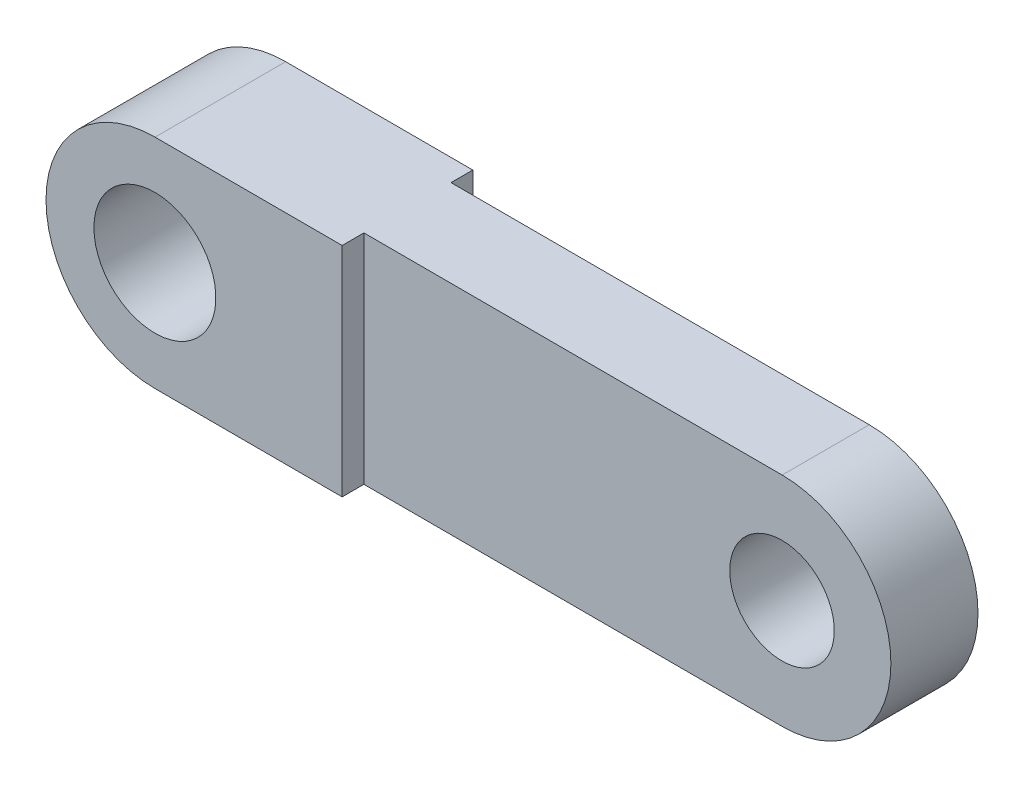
ISO-10303-21;
HEADER;
FILE_DESCRIPTION(('STEP AP214'),'2;1');
FILE_NAME('part.step','',(''),(''),'','','');
FILE_SCHEMA(('AUTOMOTIVE_DESIGN { 1 0 10303 214 1 1 1 1 }'));
ENDSEC;
DATA;
#1=APPLICATION_CONTEXT('core data for automotive mechanical design processes');
#2=APPLICATION_PROTOCOL_DEFINITION('international standard','automotive_design',2000,#1);
#3=PRODUCT_CONTEXT('',#1,'mechanical');
#4=PRODUCT('Part','Part','',(#3));
#5=PRODUCT_RELATED_PRODUCT_CATEGORY('part','',(#4));
#6=PRODUCT_DEFINITION_FORMATION('','',#4);
#7=PRODUCT_DEFINITION_CONTEXT('part definition',#1,'design');
#8=PRODUCT_DEFINITION('design','',#6,#7);
#9=PRODUCT_DEFINITION_SHAPE('','',#8);
#10=(LENGTH_UNIT() NAMED_UNIT(*) SI_UNIT(.MILLI.,.METRE.));
#11=(NAMED_UNIT(*) PLANE_ANGLE_UNIT() SI_UNIT($,.RADIAN.));
#12=(NAMED_UNIT(*) SI_UNIT($,.STERADIAN.) SOLID_ANGLE_UNIT());
#13=UNCERTAINTY_MEASURE_WITH_UNIT(LENGTH_MEASURE(1.E-05),#10,'distance_accuracy_value','');
#14=(GEOMETRIC_REPRESENTATION_CONTEXT(3) GLOBAL_UNCERTAINTY_ASSIGNED_CONTEXT((#13)) GLOBAL_UNIT_ASSIGNED_CONTEXT((#10,
#11,#12)) REPRESENTATION_CONTEXT('',''));
#15=CARTESIAN_POINT('',(0.,0.,0.));
#16=DIRECTION('',(0.,0.,1.));
#17=DIRECTION('',(1.,0.,0.));
#18=AXIS2_PLACEMENT_3D('',#15,#16,#17);
#19=CARTESIAN_POINT('',(-5.5,-0.094581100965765,-2.5));
#20=DIRECTION('',(0.,0.,-1.));
#21=DIRECTION('',(0.,1.,0.));
#22=AXIS2_PLACEMENT_3D('',#19,#20,#21);
#23=CYLINDRICAL_SURFACE('',#22,6.);
#24=CARTESIAN_POINT('',(-5.5,-0.0945811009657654,-12.5));
#25=DIRECTION('',(0.,0.,-1.));
#26=DIRECTION('',(0.,1.,0.));
#27=AXIS2_PLACEMENT_3D('',#24,#25,#26);
#28=CIRCLE('',#27,6.);
#29=CARTESIAN_POINT('',(-5.5,5.90541889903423,-12.5));
#30=VERTEX_POINT('',#29);
#31=EDGE_CURVE('E16',#30,#30,#28,.T.);
#32=ORIENTED_EDGE('',*,*,#31,.T.);
#33=EDGE_LOOP('',(#32));
#34=FACE_BOUND('',#33,.T.);
#35=CARTESIAN_POINT('',(-5.5,-0.094581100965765,-2.5));
#36=DIRECTION('',(0.,0.,-1.));
#37=DIRECTION('',(0.,1.,0.));
#38=AXIS2_PLACEMENT_3D('',#35,#36,#37);
#39=CIRCLE('',#38,6.);
#40=CARTESIAN_POINT('',(-5.5,5.90541889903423,-2.5));
#41=VERTEX_POINT('',#40);
#42=EDGE_CURVE('E94',#41,#41,#39,.F.);
#43=ORIENTED_EDGE('',*,*,#42,.T.);
#44=EDGE_LOOP('',(#43));
#45=FACE_BOUND('',#44,.T.);
#46=ADVANCED_FACE('F12',(#34,#45),#23,.F.);
#47=CARTESIAN_POINT('',(-53.5,-12.529270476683,-15.));
#48=DIRECTION('',(-1.,0.,0.));
#49=DIRECTION('',(0.,0.,1.));
#50=AXIS2_PLACEMENT_3D('',#47,#48,#49);
#51=PLANE('',#50);
#52=DIRECTION('',(0.,-1.,0.));
#53=VECTOR('',#52,1.);
#54=CARTESIAN_POINT('',(-53.5,-17.779247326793,-12.5));
#55=LINE('',#54,#53);
#56=CARTESIAN_POINT('',(-53.5000000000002,12.4707526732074,-12.5000000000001));
#57=VERTEX_POINT('',#56);
#58=CARTESIAN_POINT('',(-53.4999999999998,-12.5292704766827,-12.5000000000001));
#59=VERTEX_POINT('',#58);
#60=EDGE_CURVE('E72',#57,#59,#55,.T.);
#61=ORIENTED_EDGE('',*,*,#60,.T.);
#62=DIRECTION('',(0.,0.,1.));
#63=VECTOR('',#62,1.);
#64=CARTESIAN_POINT('',(-53.4999999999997,-12.5292704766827,-34.750032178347));
#65=LINE('',#64,#63);
#66=CARTESIAN_POINT('',(-53.4999999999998,-12.5292704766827,-15.0000000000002));
#67=VERTEX_POINT('',#66);
#68=EDGE_CURVE('E97',#67,#59,#65,.T.);
#69=ORIENTED_EDGE('',*,*,#68,.F.);
#70=DIRECTION('',(0.,-1.,0.));
#71=VECTOR('',#70,1.);
#72=CARTESIAN_POINT('',(-53.5,-4.33,-15.));
#73=LINE('',#72,#71);
#74=CARTESIAN_POINT('',(-53.5000000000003,12.4707526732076,-15.0000000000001));
#75=VERTEX_POINT('',#74);
#76=EDGE_CURVE('E79',#75,#67,#73,.T.);
#77=ORIENTED_EDGE('',*,*,#76,.F.);
#78=DIRECTION('',(0.,0.,-1.));
#79=VECTOR('',#78,1.);
#80=CARTESIAN_POINT('',(-53.5000000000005,12.4707526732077,-34.750032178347));
#81=LINE('',#80,#79);
#82=EDGE_CURVE('E116',#57,#75,#81,.T.);
#83=ORIENTED_EDGE('',*,*,#82,.F.);
#84=EDGE_LOOP('',(#61,#69,#77,#83));
#85=FACE_BOUND('',#84,.T.);
#86=ADVANCED_FACE('F98',(#85),#51,.F.);
#87=CARTESIAN_POINT('',(7.605,12.470752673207,-12.5));
#88=DIRECTION('',(0.,0.,1.));
#89=DIRECTION('',(-1.,0.,0.));
#90=AXIS2_PLACEMENT_3D('',#87,#88,#89);
#91=PLANE('',#90);
#92=ORIENTED_EDGE('',*,*,#31,.F.);
#93=EDGE_LOOP('',(#92));
#94=FACE_BOUND('',#93,.T.);
#95=CARTESIAN_POINT('',(-5.5,-0.094581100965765,-12.5));
#96=DIRECTION('',(0.,0.,1.));
#97=DIRECTION('',(1.,0.,0.));
#98=AXIS2_PLACEMENT_3D('',#95,#96,#97);
#99=CIRCLE('',#98,12.5000000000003);
#100=CARTESIAN_POINT('',(-5.48298902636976,12.4054073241,-12.5000000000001));
#101=VERTEX_POINT('',#100);
#102=CARTESIAN_POINT('',(-5.51701097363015,-12.594569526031,-12.5000000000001));
#103=VERTEX_POINT('',#102);
#104=EDGE_CURVE('E66',#101,#103,#99,.F.);
#105=ORIENTED_EDGE('',*,*,#104,.T.);
#106=DIRECTION('',(0.999999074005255,-0.0013608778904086,0.));
#107=VECTOR('',#106,1.);
#108=CARTESIAN_POINT('',(-40.2670109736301,-12.5472789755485,-12.5000000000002));
#109=LINE('',#108,#107);
#110=EDGE_CURVE('E100',#59,#103,#109,.T.);
#111=ORIENTED_EDGE('',*,*,#110,.F.);
#112=ORIENTED_EDGE('',*,*,#60,.F.);
#113=DIRECTION('',(-0.999999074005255,0.00136087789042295,0.));
#114=VECTOR('',#113,1.);
#115=CARTESIAN_POINT('',(-40.2329890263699,12.452697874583,-12.5000000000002));
#116=LINE('',#115,#114);
#117=EDGE_CURVE('E120',#101,#57,#116,.T.);
#118=ORIENTED_EDGE('',*,*,#117,.F.);
#119=EDGE_LOOP('',(#105,#111,#112,#118));
#120=FACE_BOUND('',#119,.T.);
#121=ADVANCED_FACE('F195',(#94,#120),#91,.F.);
#122=CARTESIAN_POINT('',(-5.5,-0.094581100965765,-12.5));
#123=DIRECTION('',(0.,0.,1.));
#124=DIRECTION('',(1.,0.,0.));
#125=AXIS2_PLACEMENT_3D('',#122,#123,#124);
#126=CYLINDRICAL_SURFACE('',#125,12.5000000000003);
#127=ORIENTED_EDGE('',*,*,#104,.F.);
#128=DIRECTION('',(0.,0.,-1.));
#129=VECTOR('',#128,1.);
#130=CARTESIAN_POINT('',(-5.4829890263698,12.4054073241,-34.750032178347));
#131=LINE('',#130,#129);
#132=CARTESIAN_POINT('',(-5.48298902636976,12.4054073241,-2.49999999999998));
#133=VERTEX_POINT('',#132);
#134=EDGE_CURVE('E125',#133,#101,#131,.T.);
#135=ORIENTED_EDGE('',*,*,#134,.F.);
#136=CARTESIAN_POINT('',(-5.5,-0.094581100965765,-2.5));
#137=DIRECTION('',(0.,0.,1.));
#138=DIRECTION('',(1.,0.,0.));
#139=AXIS2_PLACEMENT_3D('',#136,#137,#138);
#140=CIRCLE('',#139,12.5000000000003);
#141=CARTESIAN_POINT('',(-5.51701097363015,-12.594569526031,-2.49999999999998));
#142=VERTEX_POINT('',#141);
#143=EDGE_CURVE('E145',#133,#142,#140,.F.);
#144=ORIENTED_EDGE('',*,*,#143,.T.);
#145=DIRECTION('',(0.,0.,1.));
#146=VECTOR('',#145,1.);
#147=CARTESIAN_POINT('',(-5.5170109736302,-12.594569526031,-34.750032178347));
#148=LINE('',#147,#146);
#149=EDGE_CURVE('E156',#103,#142,#148,.T.);
#150=ORIENTED_EDGE('',*,*,#149,.F.);
#151=EDGE_LOOP('',(#127,#135,#144,#150));
#152=FACE_BOUND('',#151,.T.);
#153=ADVANCED_FACE('F194',(#152),#126,.T.);
#154=CARTESIAN_POINT('',(7.605,-13.199581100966,-2.5));
#155=DIRECTION('',(0.,0.,-1.));
#156=DIRECTION('',(-1.,0.,0.));
#157=AXIS2_PLACEMENT_3D('',#154,#155,#156);
#158=PLANE('',#157);
#159=ORIENTED_EDGE('',*,*,#42,.F.);
#160=EDGE_LOOP('',(#159));
#161=FACE_BOUND('',#160,.T.);
#162=DIRECTION('',(-0.999999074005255,0.0013608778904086,0.));
#163=VECTOR('',#162,1.);
#164=CARTESIAN_POINT('',(-40.2670109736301,-12.5472789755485,-2.49999999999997));
#165=LINE('',#164,#163);
#166=CARTESIAN_POINT('',(-53.5,-12.5292704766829,-2.49999999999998));
#167=VERTEX_POINT('',#166);
#168=EDGE_CURVE('E159',#142,#167,#165,.T.);
#169=ORIENTED_EDGE('',*,*,#168,.F.);
#170=ORIENTED_EDGE('',*,*,#143,.F.);
#171=DIRECTION('',(0.999999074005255,-0.00136087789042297,0.));
#172=VECTOR('',#171,1.);
#173=CARTESIAN_POINT('',(-40.2329890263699,12.452697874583,-2.49999999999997));
#174=LINE('',#173,#172);
#175=CARTESIAN_POINT('',(-53.5000000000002,12.4707526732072,-2.49999999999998));
#176=VERTEX_POINT('',#175);
#177=EDGE_CURVE('E93',#176,#133,#174,.T.);
#178=ORIENTED_EDGE('',*,*,#177,.F.);
#179=DIRECTION('',(0.,-1.,0.));
#180=VECTOR('',#179,1.);
#181=CARTESIAN_POINT('',(-53.5,-0.0292589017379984,-2.49999999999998));
#182=LINE('',#181,#180);
#183=EDGE_CURVE('E166',#176,#167,#182,.T.);
#184=ORIENTED_EDGE('',*,*,#183,.T.);
#185=EDGE_LOOP('',(#169,#170,#178,#184));
#186=FACE_BOUND('',#185,.T.);
#187=ADVANCED_FACE('F193',(#161,#186),#158,.F.);
#188=CARTESIAN_POINT('',(-87.84,12.84,-15.));
#189=DIRECTION('',(0.,0.,-1.));
#190=DIRECTION('',(1.,0.,0.));
#191=AXIS2_PLACEMENT_3D('',#188,#189,#190);
#192=PLANE('',#191);
#193=CARTESIAN_POINT('',(-75.,0.,-15.));
#194=DIRECTION('',(0.,0.,-1.));
#195=DIRECTION('',(-1.,0.,0.));
#196=AXIS2_PLACEMENT_3D('',#193,#194,#195);
#197=CIRCLE('',#196,6.99999999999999);
#198=CARTESIAN_POINT('',(-82.,0.,-15.));
#199=VERTEX_POINT('',#198);
#200=EDGE_CURVE('E139',#199,#199,#197,.T.);
#201=ORIENTED_EDGE('',*,*,#200,.F.);
#202=EDGE_LOOP('',(#201));
#203=FACE_BOUND('',#202,.T.);
#204=CARTESIAN_POINT('',(-75.,0.,-15.));
#205=DIRECTION('',(0.,0.,1.));
#206=DIRECTION('',(0.,-1.,0.));
#207=AXIS2_PLACEMENT_3D('',#204,#205,#206);
#208=CIRCLE('',#207,12.5000000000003);
#209=CARTESIAN_POINT('',(-75.0170109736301,-12.499988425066,-15.0000000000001));
#210=VERTEX_POINT('',#209);
#211=CARTESIAN_POINT('',(-74.9829890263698,12.499988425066,-15.0000000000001));
#212=VERTEX_POINT('',#211);
#213=EDGE_CURVE('E115',#210,#212,#208,.F.);
#214=ORIENTED_EDGE('',*,*,#213,.T.);
#215=DIRECTION('',(-0.999999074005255,0.00136087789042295,0.));
#216=VECTOR('',#215,1.);
#217=CARTESIAN_POINT('',(-40.2329890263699,12.452697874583,-15.0000000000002));
#218=LINE('',#217,#216);
#219=EDGE_CURVE('E91',#75,#212,#218,.T.);
#220=ORIENTED_EDGE('',*,*,#219,.F.);
#221=ORIENTED_EDGE('',*,*,#76,.T.);
#222=DIRECTION('',(0.999999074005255,-0.00136087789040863,0.));
#223=VECTOR('',#222,1.);
#224=CARTESIAN_POINT('',(-40.2670109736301,-12.5472789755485,-15.0000000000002));
#225=LINE('',#224,#223);
#226=EDGE_CURVE('E88',#210,#67,#225,.T.);
#227=ORIENTED_EDGE('',*,*,#226,.F.);
#228=EDGE_LOOP('',(#214,#220,#221,#227));
#229=FACE_BOUND('',#228,.T.);
#230=ADVANCED_FACE('F86',(#203,#229),#192,.T.);
#231=CARTESIAN_POINT('',(-5.4829890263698,12.4054073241,0.));
#232=DIRECTION('',(0.00136087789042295,0.999999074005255,0.));
#233=DIRECTION('',(0.,0.,-1.));
#234=AXIS2_PLACEMENT_3D('',#231,#232,#233);
#235=PLANE('',#234);
#236=ORIENTED_EDGE('',*,*,#219,.T.);
#237=DIRECTION('',(0.,0.,1.));
#238=VECTOR('',#237,1.);
#239=CARTESIAN_POINT('',(-74.9829890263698,12.499988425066,-7.5));
#240=LINE('',#239,#238);
#241=CARTESIAN_POINT('',(-74.9829890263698,12.4999884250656,0.));
#242=VERTEX_POINT('',#241);
#243=EDGE_CURVE('E105',#212,#242,#240,.T.);
#244=ORIENTED_EDGE('',*,*,#243,.T.);
#245=DIRECTION('',(-0.999999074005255,0.00136087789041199,0.));
#246=VECTOR('',#245,1.);
#247=CARTESIAN_POINT('',(-53.5,12.4707526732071,0.));
#248=LINE('',#247,#246);
#249=CARTESIAN_POINT('',(-53.5,12.4707526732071,0.));
#250=VERTEX_POINT('',#249);
#251=EDGE_CURVE('E136',#250,#242,#248,.T.);
#252=ORIENTED_EDGE('',*,*,#251,.F.);
#253=DIRECTION('',(0.,0.,-1.));
#254=VECTOR('',#253,1.);
#255=CARTESIAN_POINT('',(-53.5,12.470752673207,-12.500011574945));
#256=LINE('',#255,#254);
#257=EDGE_CURVE('E169',#250,#176,#256,.T.);
#258=ORIENTED_EDGE('',*,*,#257,.T.);
#259=ORIENTED_EDGE('',*,*,#177,.T.);
#260=ORIENTED_EDGE('',*,*,#134,.T.);
#261=ORIENTED_EDGE('',*,*,#117,.T.);
#262=ORIENTED_EDGE('',*,*,#82,.T.);
#263=EDGE_LOOP('',(#236,#244,#252,#258,#259,#260,#261,#262));
#264=FACE_BOUND('',#263,.T.);
#265=ADVANCED_FACE('F188',(#264),#235,.T.);
#266=CARTESIAN_POINT('',(-75.,0.,-15.));
#267=DIRECTION('',(0.,0.,1.));
#268=DIRECTION('',(0.,-1.,0.));
#269=AXIS2_PLACEMENT_3D('',#266,#267,#268);
#270=CYLINDRICAL_SURFACE('',#269,12.5000000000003);
#271=ORIENTED_EDGE('',*,*,#243,.F.);
#272=ORIENTED_EDGE('',*,*,#213,.F.);
#273=DIRECTION('',(0.,0.,-1.));
#274=VECTOR('',#273,1.);
#275=CARTESIAN_POINT('',(-75.01701097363,-12.499988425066,-34.750032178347));
#276=LINE('',#275,#274);
#277=CARTESIAN_POINT('',(-75.0170109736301,-12.499988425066,0.));
#278=VERTEX_POINT('',#277);
#279=EDGE_CURVE('E103',#278,#210,#276,.T.);
#280=ORIENTED_EDGE('',*,*,#279,.F.);
#281=CARTESIAN_POINT('',(-75.,0.,0.));
#282=DIRECTION('',(0.,0.,1.));
#283=DIRECTION('',(0.,-1.,0.));
#284=AXIS2_PLACEMENT_3D('',#281,#282,#283);
#285=CIRCLE('',#284,12.5000000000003);
#286=EDGE_CURVE('E133',#242,#278,#285,.T.);
#287=ORIENTED_EDGE('',*,*,#286,.F.);
#288=EDGE_LOOP('',(#271,#272,#280,#287));
#289=FACE_BOUND('',#288,.T.);
#290=ADVANCED_FACE('F218',(#289),#270,.T.);
#291=CARTESIAN_POINT('',(-75.01701097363,-12.499988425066,0.));
#292=DIRECTION('',(-0.0013608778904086,-0.999999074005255,0.));
#293=DIRECTION('',(0.,0.,-1.));
#294=AXIS2_PLACEMENT_3D('',#291,#292,#293);
#295=PLANE('',#294);
#296=ORIENTED_EDGE('',*,*,#168,.T.);
#297=DIRECTION('',(0.,0.,1.));
#298=VECTOR('',#297,1.);
#299=CARTESIAN_POINT('',(-53.5,-12.529270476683,-12.500011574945));
#300=LINE('',#299,#298);
#301=CARTESIAN_POINT('',(-53.5,-12.529270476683,0.));
#302=VERTEX_POINT('',#301);
#303=EDGE_CURVE('E31',#167,#302,#300,.T.);
#304=ORIENTED_EDGE('',*,*,#303,.T.);
#305=DIRECTION('',(0.999999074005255,-0.00136087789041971,0.));
#306=VECTOR('',#305,1.);
#307=CARTESIAN_POINT('',(-75.0170109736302,-12.499988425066,0.));
#308=LINE('',#307,#306);
#309=EDGE_CURVE('E130',#278,#302,#308,.T.);
#310=ORIENTED_EDGE('',*,*,#309,.F.);
#311=ORIENTED_EDGE('',*,*,#279,.T.);
#312=ORIENTED_EDGE('',*,*,#226,.T.);
#313=ORIENTED_EDGE('',*,*,#68,.T.);
#314=ORIENTED_EDGE('',*,*,#110,.T.);
#315=ORIENTED_EDGE('',*,*,#149,.T.);
#316=EDGE_LOOP('',(#296,#304,#310,#311,#312,#313,#314,#315));
#317=FACE_BOUND('',#316,.T.);
#318=ADVANCED_FACE('F102',(#317),#295,.T.);
#319=CARTESIAN_POINT('',(-53.5,12.470752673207,0.));
#320=DIRECTION('',(-1.,0.,0.));
#321=DIRECTION('',(0.,0.,-1.));
#322=AXIS2_PLACEMENT_3D('',#319,#320,#321);
#323=PLANE('',#322);
#324=ORIENTED_EDGE('',*,*,#303,.F.);
#325=ORIENTED_EDGE('',*,*,#183,.F.);
#326=ORIENTED_EDGE('',*,*,#257,.F.);
#327=DIRECTION('',(0.,1.,0.));
#328=VECTOR('',#327,1.);
#329=CARTESIAN_POINT('',(-53.5,4.470729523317,0.));
#330=LINE('',#329,#328);
#331=EDGE_CURVE('E22',#302,#250,#330,.T.);
#332=ORIENTED_EDGE('',*,*,#331,.F.);
#333=EDGE_LOOP('',(#324,#325,#326,#332));
#334=FACE_BOUND('',#333,.T.);
#335=ADVANCED_FACE('F185',(#334),#323,.F.);
#336=CARTESIAN_POINT('',(-75.,0.,0.));
#337=DIRECTION('',(0.,0.,-1.));
#338=DIRECTION('',(-1.,0.,0.));
#339=AXIS2_PLACEMENT_3D('',#336,#337,#338);
#340=CYLINDRICAL_SURFACE('',#339,6.99999999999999);
#341=ORIENTED_EDGE('',*,*,#200,.T.);
#342=EDGE_LOOP('',(#341));
#343=FACE_BOUND('',#342,.T.);
#344=CARTESIAN_POINT('',(-75.,0.,0.));
#345=DIRECTION('',(0.,0.,-1.));
#346=DIRECTION('',(-1.,0.,0.));
#347=AXIS2_PLACEMENT_3D('',#344,#345,#346);
#348=CIRCLE('',#347,6.99999999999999);
#349=CARTESIAN_POINT('',(-82.,0.,0.));
#350=VERTEX_POINT('',#349);
#351=EDGE_CURVE('E9',#350,#350,#348,.T.);
#352=ORIENTED_EDGE('',*,*,#351,.F.);
#353=EDGE_LOOP('',(#352));
#354=FACE_BOUND('',#353,.T.);
#355=ADVANCED_FACE('F207',(#343,#354),#340,.F.);
#356=CARTESIAN_POINT('',(-87.84,-12.529270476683,0.));
#357=DIRECTION('',(0.,0.,1.));
#358=DIRECTION('',(1.,0.,0.));
#359=AXIS2_PLACEMENT_3D('',#356,#357,#358);
#360=PLANE('',#359);
#361=ORIENTED_EDGE('',*,*,#351,.T.);
#362=EDGE_LOOP('',(#361));
#363=FACE_BOUND('',#362,.T.);
#364=ORIENTED_EDGE('',*,*,#309,.T.);
#365=ORIENTED_EDGE('',*,*,#331,.T.);
#366=ORIENTED_EDGE('',*,*,#251,.T.);
#367=ORIENTED_EDGE('',*,*,#286,.T.);
#368=EDGE_LOOP('',(#364,#365,#366,#367));
#369=FACE_BOUND('',#368,.T.);
#370=ADVANCED_FACE('F14',(#363,#369),#360,.T.);
#371=CLOSED_SHELL('',(#46,#86,#121,#153,#187,#230,#265,#290,#318,#335,#355,#370));
#372=MANIFOLD_SOLID_BREP('B1',#371);
#373=ADVANCED_BREP_SHAPE_REPRESENTATION('',(#18,#372),#14);
#374=SHAPE_DEFINITION_REPRESENTATION(#9,#373);
ENDSEC;
END-ISO-10303-21;
